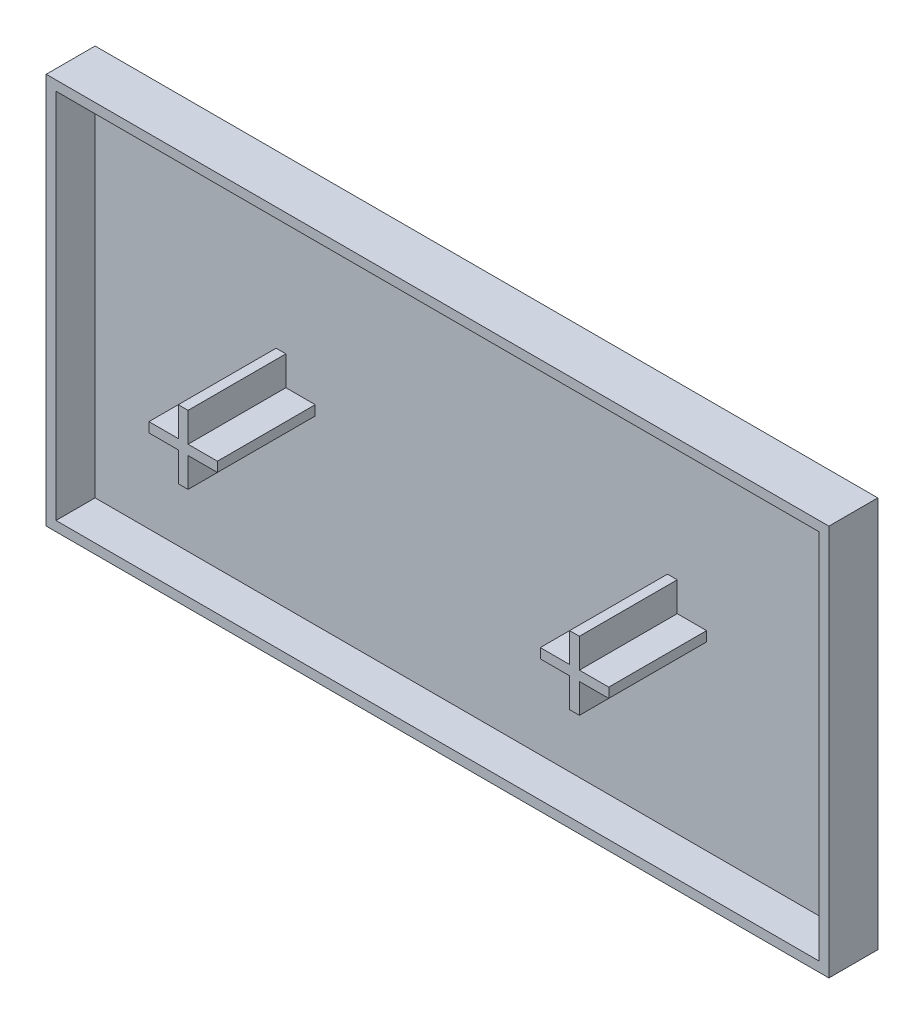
ISO-10303-21;
HEADER;
FILE_DESCRIPTION(('STEP AP214'),'2;1');
FILE_NAME('part.step','',(''),(''),'','','');
FILE_SCHEMA(('AUTOMOTIVE_DESIGN { 1 0 10303 214 1 1 1 1 }'));
ENDSEC;
DATA;
#1=APPLICATION_CONTEXT('core data for automotive mechanical design processes');
#2=APPLICATION_PROTOCOL_DEFINITION('international standard','automotive_design',2000,#1);
#3=PRODUCT_CONTEXT('',#1,'mechanical');
#4=PRODUCT('Part','Part','',(#3));
#5=PRODUCT_RELATED_PRODUCT_CATEGORY('part','',(#4));
#6=PRODUCT_DEFINITION_FORMATION('','',#4);
#7=PRODUCT_DEFINITION_CONTEXT('part definition',#1,'design');
#8=PRODUCT_DEFINITION('design','',#6,#7);
#9=PRODUCT_DEFINITION_SHAPE('','',#8);
#10=(LENGTH_UNIT() NAMED_UNIT(*) SI_UNIT(.MILLI.,.METRE.));
#11=(NAMED_UNIT(*) PLANE_ANGLE_UNIT() SI_UNIT($,.RADIAN.));
#12=(NAMED_UNIT(*) SI_UNIT($,.STERADIAN.) SOLID_ANGLE_UNIT());
#13=UNCERTAINTY_MEASURE_WITH_UNIT(LENGTH_MEASURE(1.E-05),#10,'distance_accuracy_value','');
#14=(GEOMETRIC_REPRESENTATION_CONTEXT(3) GLOBAL_UNCERTAINTY_ASSIGNED_CONTEXT((#13)) GLOBAL_UNIT_ASSIGNED_CONTEXT((#10,
#11,#12)) REPRESENTATION_CONTEXT('',''));
#15=CARTESIAN_POINT('',(0.,0.,0.));
#16=DIRECTION('',(0.,0.,1.));
#17=DIRECTION('',(1.,0.,0.));
#18=AXIS2_PLACEMENT_3D('',#15,#16,#17);
#19=CARTESIAN_POINT('',(0.,0.,-1.5));
#20=DIRECTION('',(0.,0.,1.));
#21=DIRECTION('',(1.,0.,0.));
#22=AXIS2_PLACEMENT_3D('',#19,#20,#21);
#23=PLANE('',#22);
#24=DIRECTION('',(1.,0.,0.));
#25=VECTOR('',#24,1.);
#26=CARTESIAN_POINT('',(-23.5,-0.5,-1.5));
#27=LINE('',#26,#25);
#28=CARTESIAN_POINT('',(-23.5,-0.5,-1.5));
#29=VERTEX_POINT('',#28);
#30=CARTESIAN_POINT('',(-20.5,-0.5,-1.5));
#31=VERTEX_POINT('',#30);
#32=EDGE_CURVE('E273',#29,#31,#27,.T.);
#33=ORIENTED_EDGE('',*,*,#32,.F.);
#34=DIRECTION('',(0.,-1.,0.));
#35=VECTOR('',#34,1.);
#36=CARTESIAN_POINT('',(-23.5,0.5,-1.5));
#37=LINE('',#36,#35);
#38=CARTESIAN_POINT('',(-23.5,0.5,-1.5));
#39=VERTEX_POINT('',#38);
#40=EDGE_CURVE('E270',#39,#29,#37,.T.);
#41=ORIENTED_EDGE('',*,*,#40,.F.);
#42=DIRECTION('',(-1.,0.,0.));
#43=VECTOR('',#42,1.);
#44=CARTESIAN_POINT('',(-23.5,0.5,-1.5));
#45=LINE('',#44,#43);
#46=CARTESIAN_POINT('',(-20.5,0.5,-1.5));
#47=VERTEX_POINT('',#46);
#48=EDGE_CURVE('E283',#47,#39,#45,.T.);
#49=ORIENTED_EDGE('',*,*,#48,.F.);
#50=DIRECTION('',(0.,-1.,0.));
#51=VECTOR('',#50,1.);
#52=CARTESIAN_POINT('',(-20.5,3.5,-1.5));
#53=LINE('',#52,#51);
#54=CARTESIAN_POINT('',(-20.5,3.5,-1.5));
#55=VERTEX_POINT('',#54);
#56=EDGE_CURVE('E323',#55,#47,#53,.T.);
#57=ORIENTED_EDGE('',*,*,#56,.F.);
#58=DIRECTION('',(-1.,0.,0.));
#59=VECTOR('',#58,1.);
#60=CARTESIAN_POINT('',(-20.5,3.5,-1.5));
#61=LINE('',#60,#59);
#62=CARTESIAN_POINT('',(-19.5,3.5,-1.5));
#63=VERTEX_POINT('',#62);
#64=EDGE_CURVE('E321',#63,#55,#61,.T.);
#65=ORIENTED_EDGE('',*,*,#64,.F.);
#66=DIRECTION('',(0.,1.,0.));
#67=VECTOR('',#66,1.);
#68=CARTESIAN_POINT('',(-19.5,3.5,-1.5));
#69=LINE('',#68,#67);
#70=CARTESIAN_POINT('',(-19.5,0.5,-1.5));
#71=VERTEX_POINT('',#70);
#72=EDGE_CURVE('E319',#71,#63,#69,.T.);
#73=ORIENTED_EDGE('',*,*,#72,.F.);
#74=DIRECTION('',(-1.,0.,0.));
#75=VECTOR('',#74,1.);
#76=CARTESIAN_POINT('',(-19.5,0.5,-1.5));
#77=LINE('',#76,#75);
#78=CARTESIAN_POINT('',(-16.5,0.5,-1.5));
#79=VERTEX_POINT('',#78);
#80=EDGE_CURVE('E317',#79,#71,#77,.T.);
#81=ORIENTED_EDGE('',*,*,#80,.F.);
#82=DIRECTION('',(0.,1.,0.));
#83=VECTOR('',#82,1.);
#84=CARTESIAN_POINT('',(-16.5,0.5,-1.5));
#85=LINE('',#84,#83);
#86=CARTESIAN_POINT('',(-16.5,-0.5,-1.5));
#87=VERTEX_POINT('',#86);
#88=EDGE_CURVE('E315',#87,#79,#85,.T.);
#89=ORIENTED_EDGE('',*,*,#88,.F.);
#90=DIRECTION('',(1.,0.,0.));
#91=VECTOR('',#90,1.);
#92=CARTESIAN_POINT('',(-19.5,-0.5,-1.5));
#93=LINE('',#92,#91);
#94=CARTESIAN_POINT('',(-19.5,-0.5,-1.5));
#95=VERTEX_POINT('',#94);
#96=EDGE_CURVE('E313',#95,#87,#93,.T.);
#97=ORIENTED_EDGE('',*,*,#96,.F.);
#98=DIRECTION('',(0.,1.,0.));
#99=VECTOR('',#98,1.);
#100=CARTESIAN_POINT('',(-19.5,-0.5,-1.5));
#101=LINE('',#100,#99);
#102=CARTESIAN_POINT('',(-19.5,-3.5,-1.5));
#103=VERTEX_POINT('',#102);
#104=EDGE_CURVE('E311',#103,#95,#101,.T.);
#105=ORIENTED_EDGE('',*,*,#104,.F.);
#106=DIRECTION('',(1.,0.,0.));
#107=VECTOR('',#106,1.);
#108=CARTESIAN_POINT('',(-20.5,-3.5,-1.5));
#109=LINE('',#108,#107);
#110=CARTESIAN_POINT('',(-20.5,-3.5,-1.5));
#111=VERTEX_POINT('',#110);
#112=EDGE_CURVE('E309',#111,#103,#109,.T.);
#113=ORIENTED_EDGE('',*,*,#112,.F.);
#114=DIRECTION('',(0.,-1.,0.));
#115=VECTOR('',#114,1.);
#116=CARTESIAN_POINT('',(-20.5,-0.5,-1.5));
#117=LINE('',#116,#115);
#118=EDGE_CURVE('E307',#31,#111,#117,.T.);
#119=ORIENTED_EDGE('',*,*,#118,.F.);
#120=EDGE_LOOP('',(#33,#41,#49,#57,#65,#73,#81,#89,#97,#105,#113,#119));
#121=FACE_BOUND('',#120,.T.);
#122=DIRECTION('',(0.,-1.,0.));
#123=VECTOR('',#122,1.);
#124=CARTESIAN_POINT('',(-39.,20.,-1.5));
#125=LINE('',#124,#123);
#126=CARTESIAN_POINT('',(-39.,19.,-1.5));
#127=VERTEX_POINT('',#126);
#128=CARTESIAN_POINT('',(-39.,-19.,-1.5));
#129=VERTEX_POINT('',#128);
#130=EDGE_CURVE('E358',#127,#129,#125,.T.);
#131=ORIENTED_EDGE('',*,*,#130,.T.);
#132=DIRECTION('',(1.,0.,0.));
#133=VECTOR('',#132,1.);
#134=CARTESIAN_POINT('',(-40.,-19.,-1.5));
#135=LINE('',#134,#133);
#136=CARTESIAN_POINT('',(39.,-19.,-1.5));
#137=VERTEX_POINT('',#136);
#138=EDGE_CURVE('E361',#129,#137,#135,.T.);
#139=ORIENTED_EDGE('',*,*,#138,.T.);
#140=DIRECTION('',(0.,1.,0.));
#141=VECTOR('',#140,1.);
#142=CARTESIAN_POINT('',(39.,20.,-1.5));
#143=LINE('',#142,#141);
#144=CARTESIAN_POINT('',(39.,19.,-1.5));
#145=VERTEX_POINT('',#144);
#146=EDGE_CURVE('E373',#137,#145,#143,.T.);
#147=ORIENTED_EDGE('',*,*,#146,.T.);
#148=DIRECTION('',(-1.,0.,0.));
#149=VECTOR('',#148,1.);
#150=CARTESIAN_POINT('',(-40.,19.,-1.5));
#151=LINE('',#150,#149);
#152=EDGE_CURVE('E377',#145,#127,#151,.T.);
#153=ORIENTED_EDGE('',*,*,#152,.T.);
#154=EDGE_LOOP('',(#131,#139,#147,#153));
#155=FACE_BOUND('',#154,.T.);
#156=DIRECTION('',(1.,0.,0.));
#157=VECTOR('',#156,1.);
#158=CARTESIAN_POINT('',(20.5,-3.49999999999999,-1.5));
#159=LINE('',#158,#157);
#160=CARTESIAN_POINT('',(19.5,-3.49999999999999,-1.5));
#161=VERTEX_POINT('',#160);
#162=CARTESIAN_POINT('',(20.5,-3.49999999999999,-1.5));
#163=VERTEX_POINT('',#162);
#164=EDGE_CURVE('E809',#161,#163,#159,.T.);
#165=ORIENTED_EDGE('',*,*,#164,.F.);
#166=DIRECTION('',(0.,-1.,0.));
#167=VECTOR('',#166,1.);
#168=CARTESIAN_POINT('',(19.5,-0.499999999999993,-1.5));
#169=LINE('',#168,#167);
#170=CARTESIAN_POINT('',(19.5,-0.499999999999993,-1.5));
#171=VERTEX_POINT('',#170);
#172=EDGE_CURVE('E268',#171,#161,#169,.T.);
#173=ORIENTED_EDGE('',*,*,#172,.F.);
#174=DIRECTION('',(1.,0.,0.));
#175=VECTOR('',#174,1.);
#176=CARTESIAN_POINT('',(19.5,-0.499999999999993,-1.5));
#177=LINE('',#176,#175);
#178=CARTESIAN_POINT('',(16.5,-0.499999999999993,-1.5));
#179=VERTEX_POINT('',#178);
#180=EDGE_CURVE('E264',#179,#171,#177,.T.);
#181=ORIENTED_EDGE('',*,*,#180,.F.);
#182=DIRECTION('',(0.,-1.,0.));
#183=VECTOR('',#182,1.);
#184=CARTESIAN_POINT('',(16.5,0.500000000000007,-1.5));
#185=LINE('',#184,#183);
#186=CARTESIAN_POINT('',(16.5,0.500000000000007,-1.5));
#187=VERTEX_POINT('',#186);
#188=EDGE_CURVE('E805',#187,#179,#185,.T.);
#189=ORIENTED_EDGE('',*,*,#188,.F.);
#190=DIRECTION('',(-1.,0.,0.));
#191=VECTOR('',#190,1.);
#192=CARTESIAN_POINT('',(19.5,0.500000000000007,-1.5));
#193=LINE('',#192,#191);
#194=CARTESIAN_POINT('',(19.5,0.500000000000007,-1.5));
#195=VERTEX_POINT('',#194);
#196=EDGE_CURVE('E829',#195,#187,#193,.T.);
#197=ORIENTED_EDGE('',*,*,#196,.F.);
#198=DIRECTION('',(0.,-1.,0.));
#199=VECTOR('',#198,1.);
#200=CARTESIAN_POINT('',(19.5,3.50000000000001,-1.5));
#201=LINE('',#200,#199);
#202=CARTESIAN_POINT('',(19.5,3.50000000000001,-1.5));
#203=VERTEX_POINT('',#202);
#204=EDGE_CURVE('E827',#203,#195,#201,.T.);
#205=ORIENTED_EDGE('',*,*,#204,.F.);
#206=DIRECTION('',(-1.,0.,0.));
#207=VECTOR('',#206,1.);
#208=CARTESIAN_POINT('',(20.5,3.50000000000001,-1.5));
#209=LINE('',#208,#207);
#210=CARTESIAN_POINT('',(20.5,3.50000000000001,-1.5));
#211=VERTEX_POINT('',#210);
#212=EDGE_CURVE('E825',#211,#203,#209,.T.);
#213=ORIENTED_EDGE('',*,*,#212,.F.);
#214=DIRECTION('',(0.,1.,0.));
#215=VECTOR('',#214,1.);
#216=CARTESIAN_POINT('',(20.5,3.50000000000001,-1.5));
#217=LINE('',#216,#215);
#218=CARTESIAN_POINT('',(20.5,0.500000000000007,-1.5));
#219=VERTEX_POINT('',#218);
#220=EDGE_CURVE('E823',#219,#211,#217,.T.);
#221=ORIENTED_EDGE('',*,*,#220,.F.);
#222=DIRECTION('',(-1.,0.,0.));
#223=VECTOR('',#222,1.);
#224=CARTESIAN_POINT('',(23.5,0.500000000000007,-1.5));
#225=LINE('',#224,#223);
#226=CARTESIAN_POINT('',(23.5,0.500000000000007,-1.5));
#227=VERTEX_POINT('',#226);
#228=EDGE_CURVE('E821',#227,#219,#225,.T.);
#229=ORIENTED_EDGE('',*,*,#228,.F.);
#230=DIRECTION('',(0.,1.,0.));
#231=VECTOR('',#230,1.);
#232=CARTESIAN_POINT('',(23.5,0.500000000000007,-1.5));
#233=LINE('',#232,#231);
#234=CARTESIAN_POINT('',(23.5,-0.499999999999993,-1.5));
#235=VERTEX_POINT('',#234);
#236=EDGE_CURVE('E819',#235,#227,#233,.T.);
#237=ORIENTED_EDGE('',*,*,#236,.F.);
#238=DIRECTION('',(1.,0.,0.));
#239=VECTOR('',#238,1.);
#240=CARTESIAN_POINT('',(23.5,-0.499999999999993,-1.5));
#241=LINE('',#240,#239);
#242=CARTESIAN_POINT('',(20.5,-0.499999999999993,-1.5));
#243=VERTEX_POINT('',#242);
#244=EDGE_CURVE('E817',#243,#235,#241,.T.);
#245=ORIENTED_EDGE('',*,*,#244,.F.);
#246=DIRECTION('',(0.,1.,0.));
#247=VECTOR('',#246,1.);
#248=CARTESIAN_POINT('',(20.5,-0.499999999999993,-1.5));
#249=LINE('',#248,#247);
#250=EDGE_CURVE('E811',#163,#243,#249,.T.);
#251=ORIENTED_EDGE('',*,*,#250,.F.);
#252=EDGE_LOOP('',(#165,#173,#181,#189,#197,#205,#213,#221,#229,#237,#245,#251));
#253=FACE_BOUND('',#252,.T.);
#254=ADVANCED_FACE('F35',(#121,#155,#253),#23,.T.);
#255=CARTESIAN_POINT('',(-40.,20.,2.5));
#256=DIRECTION('',(1.,0.,0.));
#257=DIRECTION('',(0.,1.,0.));
#258=AXIS2_PLACEMENT_3D('',#255,#256,#257);
#259=PLANE('',#258);
#260=DIRECTION('',(0.,-1.,0.));
#261=VECTOR('',#260,1.);
#262=CARTESIAN_POINT('',(-40.,20.,-2.5));
#263=LINE('',#262,#261);
#264=CARTESIAN_POINT('',(-40.,20.,-2.5));
#265=VERTEX_POINT('',#264);
#266=CARTESIAN_POINT('',(-40.,-20.,-2.5));
#267=VERTEX_POINT('',#266);
#268=EDGE_CURVE('E365',#265,#267,#263,.T.);
#269=ORIENTED_EDGE('',*,*,#268,.T.);
#270=DIRECTION('',(0.,0.,-1.));
#271=VECTOR('',#270,1.);
#272=CARTESIAN_POINT('',(-40.,-20.,2.5));
#273=LINE('',#272,#271);
#274=CARTESIAN_POINT('',(-40.,-20.,2.5));
#275=VERTEX_POINT('',#274);
#276=EDGE_CURVE('E11',#275,#267,#273,.T.);
#277=ORIENTED_EDGE('',*,*,#276,.F.);
#278=DIRECTION('',(0.,-1.,0.));
#279=VECTOR('',#278,1.);
#280=CARTESIAN_POINT('',(-40.,20.,2.5));
#281=LINE('',#280,#279);
#282=CARTESIAN_POINT('',(-40.,20.,2.5));
#283=VERTEX_POINT('',#282);
#284=EDGE_CURVE('E389',#283,#275,#281,.T.);
#285=ORIENTED_EDGE('',*,*,#284,.F.);
#286=DIRECTION('',(0.,0.,-1.));
#287=VECTOR('',#286,1.);
#288=CARTESIAN_POINT('',(-40.,20.,2.5));
#289=LINE('',#288,#287);
#290=EDGE_CURVE('E399',#283,#265,#289,.T.);
#291=ORIENTED_EDGE('',*,*,#290,.T.);
#292=EDGE_LOOP('',(#269,#277,#285,#291));
#293=FACE_BOUND('',#292,.T.);
#294=ADVANCED_FACE('F37',(#293),#259,.F.);
#295=CARTESIAN_POINT('',(-40.,-20.,2.5));
#296=DIRECTION('',(0.,1.,0.));
#297=DIRECTION('',(-1.,0.,0.));
#298=AXIS2_PLACEMENT_3D('',#295,#296,#297);
#299=PLANE('',#298);
#300=DIRECTION('',(1.,0.,0.));
#301=VECTOR('',#300,1.);
#302=CARTESIAN_POINT('',(-40.,-20.,-2.5));
#303=LINE('',#302,#301);
#304=CARTESIAN_POINT('',(40.,-20.,-2.5));
#305=VERTEX_POINT('',#304);
#306=EDGE_CURVE('E402',#267,#305,#303,.T.);
#307=ORIENTED_EDGE('',*,*,#306,.T.);
#308=DIRECTION('',(0.,0.,-1.));
#309=VECTOR('',#308,1.);
#310=CARTESIAN_POINT('',(40.,-20.,2.5));
#311=LINE('',#310,#309);
#312=CARTESIAN_POINT('',(40.,-20.,2.5));
#313=VERTEX_POINT('',#312);
#314=EDGE_CURVE('E43',#313,#305,#311,.T.);
#315=ORIENTED_EDGE('',*,*,#314,.F.);
#316=DIRECTION('',(1.,0.,0.));
#317=VECTOR('',#316,1.);
#318=CARTESIAN_POINT('',(-40.,-20.,2.5));
#319=LINE('',#318,#317);
#320=EDGE_CURVE('E392',#275,#313,#319,.T.);
#321=ORIENTED_EDGE('',*,*,#320,.F.);
#322=ORIENTED_EDGE('',*,*,#276,.T.);
#323=EDGE_LOOP('',(#307,#315,#321,#322));
#324=FACE_BOUND('',#323,.T.);
#325=ADVANCED_FACE('F432',(#324),#299,.F.);
#326=CARTESIAN_POINT('',(40.,20.,2.5));
#327=DIRECTION('',(-1.,0.,0.));
#328=DIRECTION('',(0.,0.,1.));
#329=AXIS2_PLACEMENT_3D('',#326,#327,#328);
#330=PLANE('',#329);
#331=DIRECTION('',(0.,1.,0.));
#332=VECTOR('',#331,1.);
#333=CARTESIAN_POINT('',(40.,20.,-2.5));
#334=LINE('',#333,#332);
#335=CARTESIAN_POINT('',(40.,20.,-2.5));
#336=VERTEX_POINT('',#335);
#337=EDGE_CURVE('E404',#305,#336,#334,.T.);
#338=ORIENTED_EDGE('',*,*,#337,.T.);
#339=DIRECTION('',(0.,0.,-1.));
#340=VECTOR('',#339,1.);
#341=CARTESIAN_POINT('',(40.,20.,2.5));
#342=LINE('',#341,#340);
#343=CARTESIAN_POINT('',(40.,20.,2.5));
#344=VERTEX_POINT('',#343);
#345=EDGE_CURVE('E409',#344,#336,#342,.T.);
#346=ORIENTED_EDGE('',*,*,#345,.F.);
#347=DIRECTION('',(0.,1.,0.));
#348=VECTOR('',#347,1.);
#349=CARTESIAN_POINT('',(40.,20.,2.5));
#350=LINE('',#349,#348);
#351=EDGE_CURVE('E395',#313,#344,#350,.T.);
#352=ORIENTED_EDGE('',*,*,#351,.F.);
#353=ORIENTED_EDGE('',*,*,#314,.T.);
#354=EDGE_LOOP('',(#338,#346,#352,#353));
#355=FACE_BOUND('',#354,.T.);
#356=ADVANCED_FACE('F416',(#355),#330,.F.);
#357=CARTESIAN_POINT('',(-40.,20.,2.5));
#358=DIRECTION('',(0.,-1.,0.));
#359=DIRECTION('',(0.,0.,-1.));
#360=AXIS2_PLACEMENT_3D('',#357,#358,#359);
#361=PLANE('',#360);
#362=DIRECTION('',(-1.,0.,0.));
#363=VECTOR('',#362,1.);
#364=CARTESIAN_POINT('',(-40.,20.,-2.5));
#365=LINE('',#364,#363);
#366=EDGE_CURVE('E393',#336,#265,#365,.T.);
#367=ORIENTED_EDGE('',*,*,#366,.T.);
#368=ORIENTED_EDGE('',*,*,#290,.F.);
#369=DIRECTION('',(-1.,0.,0.));
#370=VECTOR('',#369,1.);
#371=CARTESIAN_POINT('',(-40.,20.,2.5));
#372=LINE('',#371,#370);
#373=EDGE_CURVE('E397',#344,#283,#372,.T.);
#374=ORIENTED_EDGE('',*,*,#373,.F.);
#375=ORIENTED_EDGE('',*,*,#345,.T.);
#376=EDGE_LOOP('',(#367,#368,#374,#375));
#377=FACE_BOUND('',#376,.T.);
#378=ADVANCED_FACE('F425',(#377),#361,.F.);
#379=CARTESIAN_POINT('',(0.,0.,2.5));
#380=DIRECTION('',(0.,0.,1.));
#381=DIRECTION('',(1.,0.,0.));
#382=AXIS2_PLACEMENT_3D('',#379,#380,#381);
#383=PLANE('',#382);
#384=DIRECTION('',(0.,-1.,0.));
#385=VECTOR('',#384,1.);
#386=CARTESIAN_POINT('',(-39.,20.,2.5));
#387=LINE('',#386,#385);
#388=CARTESIAN_POINT('',(-39.,19.,2.5));
#389=VERTEX_POINT('',#388);
#390=CARTESIAN_POINT('',(-39.,-19.,2.5));
#391=VERTEX_POINT('',#390);
#392=EDGE_CURVE('E381',#389,#391,#387,.T.);
#393=ORIENTED_EDGE('',*,*,#392,.F.);
#394=DIRECTION('',(-1.,0.,0.));
#395=VECTOR('',#394,1.);
#396=CARTESIAN_POINT('',(-40.,19.,2.5));
#397=LINE('',#396,#395);
#398=CARTESIAN_POINT('',(39.,19.,2.5));
#399=VERTEX_POINT('',#398);
#400=EDGE_CURVE('E371',#399,#389,#397,.T.);
#401=ORIENTED_EDGE('',*,*,#400,.F.);
#402=DIRECTION('',(0.,1.,0.));
#403=VECTOR('',#402,1.);
#404=CARTESIAN_POINT('',(39.,20.,2.5));
#405=LINE('',#404,#403);
#406=CARTESIAN_POINT('',(39.,-19.,2.5));
#407=VERTEX_POINT('',#406);
#408=EDGE_CURVE('E385',#407,#399,#405,.T.);
#409=ORIENTED_EDGE('',*,*,#408,.F.);
#410=DIRECTION('',(1.,0.,0.));
#411=VECTOR('',#410,1.);
#412=CARTESIAN_POINT('',(-40.,-19.,2.5));
#413=LINE('',#412,#411);
#414=EDGE_CURVE('E383',#391,#407,#413,.T.);
#415=ORIENTED_EDGE('',*,*,#414,.F.);
#416=EDGE_LOOP('',(#393,#401,#409,#415));
#417=FACE_BOUND('',#416,.T.);
#418=ORIENTED_EDGE('',*,*,#284,.T.);
#419=ORIENTED_EDGE('',*,*,#320,.T.);
#420=ORIENTED_EDGE('',*,*,#351,.T.);
#421=ORIENTED_EDGE('',*,*,#373,.T.);
#422=EDGE_LOOP('',(#418,#419,#420,#421));
#423=FACE_BOUND('',#422,.T.);
#424=ADVANCED_FACE('F431',(#417,#423),#383,.T.);
#425=CARTESIAN_POINT('',(0.,0.,-2.5));
#426=DIRECTION('',(0.,0.,1.));
#427=DIRECTION('',(1.,0.,0.));
#428=AXIS2_PLACEMENT_3D('',#425,#426,#427);
#429=PLANE('',#428);
#430=ORIENTED_EDGE('',*,*,#268,.F.);
#431=ORIENTED_EDGE('',*,*,#366,.F.);
#432=ORIENTED_EDGE('',*,*,#337,.F.);
#433=ORIENTED_EDGE('',*,*,#306,.F.);
#434=EDGE_LOOP('',(#430,#431,#432,#433));
#435=FACE_BOUND('',#434,.T.);
#436=ADVANCED_FACE('F422',(#435),#429,.F.);
#437=CARTESIAN_POINT('',(-39.,20.,2.5));
#438=DIRECTION('',(1.,0.,0.));
#439=DIRECTION('',(0.,1.,0.));
#440=AXIS2_PLACEMENT_3D('',#437,#438,#439);
#441=PLANE('',#440);
#442=ORIENTED_EDGE('',*,*,#130,.F.);
#443=DIRECTION('',(0.,0.,-1.));
#444=VECTOR('',#443,1.);
#445=CARTESIAN_POINT('',(-39.,19.,2.5));
#446=LINE('',#445,#444);
#447=EDGE_CURVE('E367',#389,#127,#446,.T.);
#448=ORIENTED_EDGE('',*,*,#447,.F.);
#449=ORIENTED_EDGE('',*,*,#392,.T.);
#450=DIRECTION('',(0.,0.,-1.));
#451=VECTOR('',#450,1.);
#452=CARTESIAN_POINT('',(-39.,-19.,2.5));
#453=LINE('',#452,#451);
#454=EDGE_CURVE('E362',#391,#129,#453,.T.);
#455=ORIENTED_EDGE('',*,*,#454,.T.);
#456=EDGE_LOOP('',(#442,#448,#449,#455));
#457=FACE_BOUND('',#456,.T.);
#458=ADVANCED_FACE('F455',(#457),#441,.T.);
#459=CARTESIAN_POINT('',(-40.,-19.,2.5));
#460=DIRECTION('',(0.,1.,0.));
#461=DIRECTION('',(-1.,0.,0.));
#462=AXIS2_PLACEMENT_3D('',#459,#460,#461);
#463=PLANE('',#462);
#464=ORIENTED_EDGE('',*,*,#138,.F.);
#465=ORIENTED_EDGE('',*,*,#454,.F.);
#466=ORIENTED_EDGE('',*,*,#414,.T.);
#467=DIRECTION('',(0.,0.,-1.));
#468=VECTOR('',#467,1.);
#469=CARTESIAN_POINT('',(39.,-19.,2.5));
#470=LINE('',#469,#468);
#471=EDGE_CURVE('E366',#407,#137,#470,.T.);
#472=ORIENTED_EDGE('',*,*,#471,.T.);
#473=EDGE_LOOP('',(#464,#465,#466,#472));
#474=FACE_BOUND('',#473,.T.);
#475=ADVANCED_FACE('F475',(#474),#463,.T.);
#476=CARTESIAN_POINT('',(39.,20.,2.5));
#477=DIRECTION('',(-1.,0.,0.));
#478=DIRECTION('',(0.,0.,1.));
#479=AXIS2_PLACEMENT_3D('',#476,#477,#478);
#480=PLANE('',#479);
#481=ORIENTED_EDGE('',*,*,#146,.F.);
#482=ORIENTED_EDGE('',*,*,#471,.F.);
#483=ORIENTED_EDGE('',*,*,#408,.T.);
#484=DIRECTION('',(0.,0.,-1.));
#485=VECTOR('',#484,1.);
#486=CARTESIAN_POINT('',(39.,19.,2.5));
#487=LINE('',#486,#485);
#488=EDGE_CURVE('E370',#399,#145,#487,.T.);
#489=ORIENTED_EDGE('',*,*,#488,.T.);
#490=EDGE_LOOP('',(#481,#482,#483,#489));
#491=FACE_BOUND('',#490,.T.);
#492=ADVANCED_FACE('F483',(#491),#480,.T.);
#493=CARTESIAN_POINT('',(-40.,19.,2.5));
#494=DIRECTION('',(0.,-1.,0.));
#495=DIRECTION('',(0.,0.,-1.));
#496=AXIS2_PLACEMENT_3D('',#493,#494,#495);
#497=PLANE('',#496);
#498=ORIENTED_EDGE('',*,*,#152,.F.);
#499=ORIENTED_EDGE('',*,*,#488,.F.);
#500=ORIENTED_EDGE('',*,*,#400,.T.);
#501=ORIENTED_EDGE('',*,*,#447,.T.);
#502=EDGE_LOOP('',(#498,#499,#500,#501));
#503=FACE_BOUND('',#502,.T.);
#504=ADVANCED_FACE('F448',(#503),#497,.T.);
#505=CARTESIAN_POINT('',(-23.5,0.5,8.5));
#506=DIRECTION('',(1.,0.,0.));
#507=DIRECTION('',(0.,0.,-1.));
#508=AXIS2_PLACEMENT_3D('',#505,#506,#507);
#509=PLANE('',#508);
#510=ORIENTED_EDGE('',*,*,#40,.T.);
#511=DIRECTION('',(0.,0.,-1.));
#512=VECTOR('',#511,1.);
#513=CARTESIAN_POINT('',(-23.5,-0.5,8.5));
#514=LINE('',#513,#512);
#515=CARTESIAN_POINT('',(-23.5,-0.5,8.5));
#516=VERTEX_POINT('',#515);
#517=EDGE_CURVE('E356',#516,#29,#514,.T.);
#518=ORIENTED_EDGE('',*,*,#517,.F.);
#519=DIRECTION('',(0.,-1.,0.));
#520=VECTOR('',#519,1.);
#521=CARTESIAN_POINT('',(-23.5,0.5,8.5));
#522=LINE('',#521,#520);
#523=CARTESIAN_POINT('',(-23.5,0.5,8.5));
#524=VERTEX_POINT('',#523);
#525=EDGE_CURVE('E279',#524,#516,#522,.T.);
#526=ORIENTED_EDGE('',*,*,#525,.F.);
#527=DIRECTION('',(0.,0.,-1.));
#528=VECTOR('',#527,1.);
#529=CARTESIAN_POINT('',(-23.5,0.5,8.5));
#530=LINE('',#529,#528);
#531=EDGE_CURVE('E304',#524,#39,#530,.T.);
#532=ORIENTED_EDGE('',*,*,#531,.T.);
#533=EDGE_LOOP('',(#510,#518,#526,#532));
#534=FACE_BOUND('',#533,.T.);
#535=ADVANCED_FACE('F497',(#534),#509,.F.);
#536=CARTESIAN_POINT('',(-23.5,-0.5,8.5));
#537=DIRECTION('',(0.,1.,0.));
#538=DIRECTION('',(0.,0.,1.));
#539=AXIS2_PLACEMENT_3D('',#536,#537,#538);
#540=PLANE('',#539);
#541=ORIENTED_EDGE('',*,*,#32,.T.);
#542=DIRECTION('',(0.,0.,-1.));
#543=VECTOR('',#542,1.);
#544=CARTESIAN_POINT('',(-20.5,-0.5,8.5));
#545=LINE('',#544,#543);
#546=CARTESIAN_POINT('',(-20.5,-0.5,8.5));
#547=VERTEX_POINT('',#546);
#548=EDGE_CURVE('E353',#547,#31,#545,.T.);
#549=ORIENTED_EDGE('',*,*,#548,.F.);
#550=DIRECTION('',(1.,0.,0.));
#551=VECTOR('',#550,1.);
#552=CARTESIAN_POINT('',(-23.5,-0.5,8.5));
#553=LINE('',#552,#551);
#554=EDGE_CURVE('E282',#516,#547,#553,.T.);
#555=ORIENTED_EDGE('',*,*,#554,.F.);
#556=ORIENTED_EDGE('',*,*,#517,.T.);
#557=EDGE_LOOP('',(#541,#549,#555,#556));
#558=FACE_BOUND('',#557,.T.);
#559=ADVANCED_FACE('F504',(#558),#540,.F.);
#560=CARTESIAN_POINT('',(-20.5,-0.5,8.5));
#561=DIRECTION('',(1.,0.,0.));
#562=DIRECTION('',(0.,0.,-1.));
#563=AXIS2_PLACEMENT_3D('',#560,#561,#562);
#564=PLANE('',#563);
#565=ORIENTED_EDGE('',*,*,#118,.T.);
#566=DIRECTION('',(0.,0.,-1.));
#567=VECTOR('',#566,1.);
#568=CARTESIAN_POINT('',(-20.5,-3.5,8.5));
#569=LINE('',#568,#567);
#570=CARTESIAN_POINT('',(-20.5,-3.5,8.5));
#571=VERTEX_POINT('',#570);
#572=EDGE_CURVE('E350',#571,#111,#569,.T.);
#573=ORIENTED_EDGE('',*,*,#572,.F.);
#574=DIRECTION('',(0.,-1.,0.));
#575=VECTOR('',#574,1.);
#576=CARTESIAN_POINT('',(-20.5,-0.5,8.5));
#577=LINE('',#576,#575);
#578=EDGE_CURVE('E285',#547,#571,#577,.T.);
#579=ORIENTED_EDGE('',*,*,#578,.F.);
#580=ORIENTED_EDGE('',*,*,#548,.T.);
#581=EDGE_LOOP('',(#565,#573,#579,#580));
#582=FACE_BOUND('',#581,.T.);
#583=ADVANCED_FACE('F512',(#582),#564,.F.);
#584=CARTESIAN_POINT('',(-20.5,-3.5,8.5));
#585=DIRECTION('',(0.,1.,0.));
#586=DIRECTION('',(0.,0.,1.));
#587=AXIS2_PLACEMENT_3D('',#584,#585,#586);
#588=PLANE('',#587);
#589=ORIENTED_EDGE('',*,*,#112,.T.);
#590=DIRECTION('',(0.,0.,-1.));
#591=VECTOR('',#590,1.);
#592=CARTESIAN_POINT('',(-19.5,-3.5,8.5));
#593=LINE('',#592,#591);
#594=CARTESIAN_POINT('',(-19.5,-3.5,8.5));
#595=VERTEX_POINT('',#594);
#596=EDGE_CURVE('E347',#595,#103,#593,.T.);
#597=ORIENTED_EDGE('',*,*,#596,.F.);
#598=DIRECTION('',(1.,0.,0.));
#599=VECTOR('',#598,1.);
#600=CARTESIAN_POINT('',(-20.5,-3.5,8.5));
#601=LINE('',#600,#599);
#602=EDGE_CURVE('E287',#571,#595,#601,.T.);
#603=ORIENTED_EDGE('',*,*,#602,.F.);
#604=ORIENTED_EDGE('',*,*,#572,.T.);
#605=EDGE_LOOP('',(#589,#597,#603,#604));
#606=FACE_BOUND('',#605,.T.);
#607=ADVANCED_FACE('F520',(#606),#588,.F.);
#608=CARTESIAN_POINT('',(-19.5,-0.5,8.5));
#609=DIRECTION('',(-1.,0.,0.));
#610=DIRECTION('',(0.,0.,1.));
#611=AXIS2_PLACEMENT_3D('',#608,#609,#610);
#612=PLANE('',#611);
#613=ORIENTED_EDGE('',*,*,#104,.T.);
#614=DIRECTION('',(0.,0.,-1.));
#615=VECTOR('',#614,1.);
#616=CARTESIAN_POINT('',(-19.5,-0.5,8.5));
#617=LINE('',#616,#615);
#618=CARTESIAN_POINT('',(-19.5,-0.5,8.5));
#619=VERTEX_POINT('',#618);
#620=EDGE_CURVE('E344',#619,#95,#617,.T.);
#621=ORIENTED_EDGE('',*,*,#620,.F.);
#622=DIRECTION('',(0.,1.,0.));
#623=VECTOR('',#622,1.);
#624=CARTESIAN_POINT('',(-19.5,-0.5,8.5));
#625=LINE('',#624,#623);
#626=EDGE_CURVE('E289',#595,#619,#625,.T.);
#627=ORIENTED_EDGE('',*,*,#626,.F.);
#628=ORIENTED_EDGE('',*,*,#596,.T.);
#629=EDGE_LOOP('',(#613,#621,#627,#628));
#630=FACE_BOUND('',#629,.T.);
#631=ADVANCED_FACE('F528',(#630),#612,.F.);
#632=CARTESIAN_POINT('',(-19.5,-0.5,8.5));
#633=DIRECTION('',(0.,1.,0.));
#634=DIRECTION('',(0.,0.,1.));
#635=AXIS2_PLACEMENT_3D('',#632,#633,#634);
#636=PLANE('',#635);
#637=ORIENTED_EDGE('',*,*,#96,.T.);
#638=DIRECTION('',(0.,0.,-1.));
#639=VECTOR('',#638,1.);
#640=CARTESIAN_POINT('',(-16.5,-0.5,8.5));
#641=LINE('',#640,#639);
#642=CARTESIAN_POINT('',(-16.5,-0.5,8.5));
#643=VERTEX_POINT('',#642);
#644=EDGE_CURVE('E341',#643,#87,#641,.T.);
#645=ORIENTED_EDGE('',*,*,#644,.F.);
#646=DIRECTION('',(1.,0.,0.));
#647=VECTOR('',#646,1.);
#648=CARTESIAN_POINT('',(-19.5,-0.5,8.5));
#649=LINE('',#648,#647);
#650=EDGE_CURVE('E291',#619,#643,#649,.T.);
#651=ORIENTED_EDGE('',*,*,#650,.F.);
#652=ORIENTED_EDGE('',*,*,#620,.T.);
#653=EDGE_LOOP('',(#637,#645,#651,#652));
#654=FACE_BOUND('',#653,.T.);
#655=ADVANCED_FACE('F536',(#654),#636,.F.);
#656=CARTESIAN_POINT('',(-16.5,0.5,8.5));
#657=DIRECTION('',(-1.,0.,0.));
#658=DIRECTION('',(0.,0.,1.));
#659=AXIS2_PLACEMENT_3D('',#656,#657,#658);
#660=PLANE('',#659);
#661=ORIENTED_EDGE('',*,*,#88,.T.);
#662=DIRECTION('',(0.,0.,-1.));
#663=VECTOR('',#662,1.);
#664=CARTESIAN_POINT('',(-16.5,0.5,8.5));
#665=LINE('',#664,#663);
#666=CARTESIAN_POINT('',(-16.5,0.5,8.5));
#667=VERTEX_POINT('',#666);
#668=EDGE_CURVE('E338',#667,#79,#665,.T.);
#669=ORIENTED_EDGE('',*,*,#668,.F.);
#670=DIRECTION('',(0.,1.,0.));
#671=VECTOR('',#670,1.);
#672=CARTESIAN_POINT('',(-16.5,0.5,8.5));
#673=LINE('',#672,#671);
#674=EDGE_CURVE('E293',#643,#667,#673,.T.);
#675=ORIENTED_EDGE('',*,*,#674,.F.);
#676=ORIENTED_EDGE('',*,*,#644,.T.);
#677=EDGE_LOOP('',(#661,#669,#675,#676));
#678=FACE_BOUND('',#677,.T.);
#679=ADVANCED_FACE('F544',(#678),#660,.F.);
#680=CARTESIAN_POINT('',(-19.5,0.5,8.5));
#681=DIRECTION('',(0.,-1.,0.));
#682=DIRECTION('',(1.,0.,0.));
#683=AXIS2_PLACEMENT_3D('',#680,#681,#682);
#684=PLANE('',#683);
#685=ORIENTED_EDGE('',*,*,#80,.T.);
#686=DIRECTION('',(0.,0.,-1.));
#687=VECTOR('',#686,1.);
#688=CARTESIAN_POINT('',(-19.5,0.5,8.5));
#689=LINE('',#688,#687);
#690=CARTESIAN_POINT('',(-19.5,0.5,8.5));
#691=VERTEX_POINT('',#690);
#692=EDGE_CURVE('E335',#691,#71,#689,.T.);
#693=ORIENTED_EDGE('',*,*,#692,.F.);
#694=DIRECTION('',(-1.,0.,0.));
#695=VECTOR('',#694,1.);
#696=CARTESIAN_POINT('',(-19.5,0.5,8.5));
#697=LINE('',#696,#695);
#698=EDGE_CURVE('E295',#667,#691,#697,.T.);
#699=ORIENTED_EDGE('',*,*,#698,.F.);
#700=ORIENTED_EDGE('',*,*,#668,.T.);
#701=EDGE_LOOP('',(#685,#693,#699,#700));
#702=FACE_BOUND('',#701,.T.);
#703=ADVANCED_FACE('F552',(#702),#684,.F.);
#704=CARTESIAN_POINT('',(-19.5,3.5,8.5));
#705=DIRECTION('',(-1.,0.,0.));
#706=DIRECTION('',(0.,0.,1.));
#707=AXIS2_PLACEMENT_3D('',#704,#705,#706);
#708=PLANE('',#707);
#709=ORIENTED_EDGE('',*,*,#72,.T.);
#710=DIRECTION('',(0.,0.,-1.));
#711=VECTOR('',#710,1.);
#712=CARTESIAN_POINT('',(-19.5,3.5,8.5));
#713=LINE('',#712,#711);
#714=CARTESIAN_POINT('',(-19.5,3.5,8.5));
#715=VERTEX_POINT('',#714);
#716=EDGE_CURVE('E332',#715,#63,#713,.T.);
#717=ORIENTED_EDGE('',*,*,#716,.F.);
#718=DIRECTION('',(0.,1.,0.));
#719=VECTOR('',#718,1.);
#720=CARTESIAN_POINT('',(-19.5,3.5,8.5));
#721=LINE('',#720,#719);
#722=EDGE_CURVE('E297',#691,#715,#721,.T.);
#723=ORIENTED_EDGE('',*,*,#722,.F.);
#724=ORIENTED_EDGE('',*,*,#692,.T.);
#725=EDGE_LOOP('',(#709,#717,#723,#724));
#726=FACE_BOUND('',#725,.T.);
#727=ADVANCED_FACE('F560',(#726),#708,.F.);
#728=CARTESIAN_POINT('',(-20.5,3.5,8.5));
#729=DIRECTION('',(0.,-1.,0.));
#730=DIRECTION('',(1.,0.,0.));
#731=AXIS2_PLACEMENT_3D('',#728,#729,#730);
#732=PLANE('',#731);
#733=ORIENTED_EDGE('',*,*,#64,.T.);
#734=DIRECTION('',(0.,0.,-1.));
#735=VECTOR('',#734,1.);
#736=CARTESIAN_POINT('',(-20.5,3.5,8.5));
#737=LINE('',#736,#735);
#738=CARTESIAN_POINT('',(-20.5,3.5,8.5));
#739=VERTEX_POINT('',#738);
#740=EDGE_CURVE('E329',#739,#55,#737,.T.);
#741=ORIENTED_EDGE('',*,*,#740,.F.);
#742=DIRECTION('',(-1.,0.,0.));
#743=VECTOR('',#742,1.);
#744=CARTESIAN_POINT('',(-20.5,3.5,8.5));
#745=LINE('',#744,#743);
#746=EDGE_CURVE('E299',#715,#739,#745,.T.);
#747=ORIENTED_EDGE('',*,*,#746,.F.);
#748=ORIENTED_EDGE('',*,*,#716,.T.);
#749=EDGE_LOOP('',(#733,#741,#747,#748));
#750=FACE_BOUND('',#749,.T.);
#751=ADVANCED_FACE('F568',(#750),#732,.F.);
#752=CARTESIAN_POINT('',(-20.5,3.5,8.5));
#753=DIRECTION('',(1.,0.,0.));
#754=DIRECTION('',(0.,0.,-1.));
#755=AXIS2_PLACEMENT_3D('',#752,#753,#754);
#756=PLANE('',#755);
#757=ORIENTED_EDGE('',*,*,#56,.T.);
#758=DIRECTION('',(0.,0.,-1.));
#759=VECTOR('',#758,1.);
#760=CARTESIAN_POINT('',(-20.5,0.5,8.5));
#761=LINE('',#760,#759);
#762=CARTESIAN_POINT('',(-20.5,0.5,8.5));
#763=VERTEX_POINT('',#762);
#764=EDGE_CURVE('E58',#763,#47,#761,.T.);
#765=ORIENTED_EDGE('',*,*,#764,.F.);
#766=DIRECTION('',(0.,-1.,0.));
#767=VECTOR('',#766,1.);
#768=CARTESIAN_POINT('',(-20.5,3.5,8.5));
#769=LINE('',#768,#767);
#770=EDGE_CURVE('E301',#739,#763,#769,.T.);
#771=ORIENTED_EDGE('',*,*,#770,.F.);
#772=ORIENTED_EDGE('',*,*,#740,.T.);
#773=EDGE_LOOP('',(#757,#765,#771,#772));
#774=FACE_BOUND('',#773,.T.);
#775=ADVANCED_FACE('F576',(#774),#756,.F.);
#776=CARTESIAN_POINT('',(-23.5,0.5,8.5));
#777=DIRECTION('',(0.,-1.,0.));
#778=DIRECTION('',(0.,0.,-1.));
#779=AXIS2_PLACEMENT_3D('',#776,#777,#778);
#780=PLANE('',#779);
#781=ORIENTED_EDGE('',*,*,#48,.T.);
#782=ORIENTED_EDGE('',*,*,#531,.F.);
#783=DIRECTION('',(-1.,0.,0.));
#784=VECTOR('',#783,1.);
#785=CARTESIAN_POINT('',(-23.5,0.5,8.5));
#786=LINE('',#785,#784);
#787=EDGE_CURVE('E303',#763,#524,#786,.T.);
#788=ORIENTED_EDGE('',*,*,#787,.F.);
#789=ORIENTED_EDGE('',*,*,#764,.T.);
#790=EDGE_LOOP('',(#781,#782,#788,#789));
#791=FACE_BOUND('',#790,.T.);
#792=ADVANCED_FACE('F584',(#791),#780,.F.);
#793=CARTESIAN_POINT('',(0.,0.,8.5));
#794=DIRECTION('',(0.,0.,1.));
#795=DIRECTION('',(1.,0.,0.));
#796=AXIS2_PLACEMENT_3D('',#793,#794,#795);
#797=PLANE('',#796);
#798=ORIENTED_EDGE('',*,*,#525,.T.);
#799=ORIENTED_EDGE('',*,*,#554,.T.);
#800=ORIENTED_EDGE('',*,*,#578,.T.);
#801=ORIENTED_EDGE('',*,*,#602,.T.);
#802=ORIENTED_EDGE('',*,*,#626,.T.);
#803=ORIENTED_EDGE('',*,*,#650,.T.);
#804=ORIENTED_EDGE('',*,*,#674,.T.);
#805=ORIENTED_EDGE('',*,*,#698,.T.);
#806=ORIENTED_EDGE('',*,*,#722,.T.);
#807=ORIENTED_EDGE('',*,*,#746,.T.);
#808=ORIENTED_EDGE('',*,*,#770,.T.);
#809=ORIENTED_EDGE('',*,*,#787,.T.);
#810=EDGE_LOOP('',(#798,#799,#800,#801,#802,#803,#804,#805,#806,#807,#808,#809));
#811=FACE_BOUND('',#810,.T.);
#812=ADVANCED_FACE('F592',(#811),#797,.T.);
#813=CARTESIAN_POINT('',(19.5,-0.499999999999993,8.5));
#814=DIRECTION('',(1.,0.,0.));
#815=DIRECTION('',(0.,0.,-1.));
#816=AXIS2_PLACEMENT_3D('',#813,#814,#815);
#817=PLANE('',#816);
#818=ORIENTED_EDGE('',*,*,#172,.T.);
#819=DIRECTION('',(0.,0.,-1.));
#820=VECTOR('',#819,1.);
#821=CARTESIAN_POINT('',(19.5,-3.49999999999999,8.5));
#822=LINE('',#821,#820);
#823=CARTESIAN_POINT('',(19.5,-3.49999999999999,8.5));
#824=VERTEX_POINT('',#823);
#825=EDGE_CURVE('E249',#824,#161,#822,.T.);
#826=ORIENTED_EDGE('',*,*,#825,.F.);
#827=DIRECTION('',(0.,-1.,0.));
#828=VECTOR('',#827,1.);
#829=CARTESIAN_POINT('',(19.5,-0.499999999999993,8.5));
#830=LINE('',#829,#828);
#831=CARTESIAN_POINT('',(19.5,-0.499999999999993,8.5));
#832=VERTEX_POINT('',#831);
#833=EDGE_CURVE('E256',#832,#824,#830,.T.);
#834=ORIENTED_EDGE('',*,*,#833,.F.);
#835=DIRECTION('',(0.,0.,-1.));
#836=VECTOR('',#835,1.);
#837=CARTESIAN_POINT('',(19.5,-0.499999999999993,8.5));
#838=LINE('',#837,#836);
#839=EDGE_CURVE('E802',#832,#171,#838,.T.);
#840=ORIENTED_EDGE('',*,*,#839,.T.);
#841=EDGE_LOOP('',(#818,#826,#834,#840));
#842=FACE_BOUND('',#841,.T.);
#843=ADVANCED_FACE('F266',(#842),#817,.F.);
#844=CARTESIAN_POINT('',(20.5,-3.49999999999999,8.5));
#845=DIRECTION('',(0.,1.,0.));
#846=DIRECTION('',(0.,0.,1.));
#847=AXIS2_PLACEMENT_3D('',#844,#845,#846);
#848=PLANE('',#847);
#849=ORIENTED_EDGE('',*,*,#164,.T.);
#850=DIRECTION('',(0.,0.,-1.));
#851=VECTOR('',#850,1.);
#852=CARTESIAN_POINT('',(20.5,-3.49999999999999,8.5));
#853=LINE('',#852,#851);
#854=CARTESIAN_POINT('',(20.5,-3.49999999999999,8.5));
#855=VERTEX_POINT('',#854);
#856=EDGE_CURVE('E252',#855,#163,#853,.T.);
#857=ORIENTED_EDGE('',*,*,#856,.F.);
#858=DIRECTION('',(1.,0.,0.));
#859=VECTOR('',#858,1.);
#860=CARTESIAN_POINT('',(20.5,-3.49999999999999,8.5));
#861=LINE('',#860,#859);
#862=EDGE_CURVE('E245',#824,#855,#861,.T.);
#863=ORIENTED_EDGE('',*,*,#862,.F.);
#864=ORIENTED_EDGE('',*,*,#825,.T.);
#865=EDGE_LOOP('',(#849,#857,#863,#864));
#866=FACE_BOUND('',#865,.T.);
#867=ADVANCED_FACE('F247',(#866),#848,.F.);
#868=CARTESIAN_POINT('',(20.5,-0.499999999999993,8.5));
#869=DIRECTION('',(-1.,0.,0.));
#870=DIRECTION('',(0.,0.,1.));
#871=AXIS2_PLACEMENT_3D('',#868,#869,#870);
#872=PLANE('',#871);
#873=ORIENTED_EDGE('',*,*,#250,.T.);
#874=DIRECTION('',(0.,0.,-1.));
#875=VECTOR('',#874,1.);
#876=CARTESIAN_POINT('',(20.5,-0.499999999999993,8.5));
#877=LINE('',#876,#875);
#878=CARTESIAN_POINT('',(20.5,-0.499999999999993,8.5));
#879=VERTEX_POINT('',#878);
#880=EDGE_CURVE('E275',#879,#243,#877,.T.);
#881=ORIENTED_EDGE('',*,*,#880,.F.);
#882=DIRECTION('',(0.,1.,0.));
#883=VECTOR('',#882,1.);
#884=CARTESIAN_POINT('',(20.5,-0.499999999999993,8.5));
#885=LINE('',#884,#883);
#886=EDGE_CURVE('E255',#855,#879,#885,.T.);
#887=ORIENTED_EDGE('',*,*,#886,.F.);
#888=ORIENTED_EDGE('',*,*,#856,.T.);
#889=EDGE_LOOP('',(#873,#881,#887,#888));
#890=FACE_BOUND('',#889,.T.);
#891=ADVANCED_FACE('F612',(#890),#872,.F.);
#892=CARTESIAN_POINT('',(23.5,-0.499999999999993,8.5));
#893=DIRECTION('',(0.,1.,0.));
#894=DIRECTION('',(0.,0.,1.));
#895=AXIS2_PLACEMENT_3D('',#892,#893,#894);
#896=PLANE('',#895);
#897=ORIENTED_EDGE('',*,*,#244,.T.);
#898=DIRECTION('',(0.,0.,-1.));
#899=VECTOR('',#898,1.);
#900=CARTESIAN_POINT('',(23.5,-0.499999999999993,8.5));
#901=LINE('',#900,#899);
#902=CARTESIAN_POINT('',(23.5,-0.499999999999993,8.5));
#903=VERTEX_POINT('',#902);
#904=EDGE_CURVE('E851',#903,#235,#901,.T.);
#905=ORIENTED_EDGE('',*,*,#904,.F.);
#906=DIRECTION('',(1.,0.,0.));
#907=VECTOR('',#906,1.);
#908=CARTESIAN_POINT('',(23.5,-0.499999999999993,8.5));
#909=LINE('',#908,#907);
#910=EDGE_CURVE('E858',#879,#903,#909,.T.);
#911=ORIENTED_EDGE('',*,*,#910,.F.);
#912=ORIENTED_EDGE('',*,*,#880,.T.);
#913=EDGE_LOOP('',(#897,#905,#911,#912));
#914=FACE_BOUND('',#913,.T.);
#915=ADVANCED_FACE('F619',(#914),#896,.F.);
#916=CARTESIAN_POINT('',(23.5,0.500000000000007,8.5));
#917=DIRECTION('',(-1.,0.,0.));
#918=DIRECTION('',(0.,0.,1.));
#919=AXIS2_PLACEMENT_3D('',#916,#917,#918);
#920=PLANE('',#919);
#921=ORIENTED_EDGE('',*,*,#236,.T.);
#922=DIRECTION('',(0.,0.,-1.));
#923=VECTOR('',#922,1.);
#924=CARTESIAN_POINT('',(23.5,0.500000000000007,8.5));
#925=LINE('',#924,#923);
#926=CARTESIAN_POINT('',(23.5,0.500000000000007,8.5));
#927=VERTEX_POINT('',#926);
#928=EDGE_CURVE('E848',#927,#227,#925,.T.);
#929=ORIENTED_EDGE('',*,*,#928,.F.);
#930=DIRECTION('',(0.,1.,0.));
#931=VECTOR('',#930,1.);
#932=CARTESIAN_POINT('',(23.5,0.500000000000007,8.5));
#933=LINE('',#932,#931);
#934=EDGE_CURVE('E869',#903,#927,#933,.T.);
#935=ORIENTED_EDGE('',*,*,#934,.F.);
#936=ORIENTED_EDGE('',*,*,#904,.T.);
#937=EDGE_LOOP('',(#921,#929,#935,#936));
#938=FACE_BOUND('',#937,.T.);
#939=ADVANCED_FACE('F627',(#938),#920,.F.);
#940=CARTESIAN_POINT('',(23.5,0.500000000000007,8.5));
#941=DIRECTION('',(0.,-1.,0.));
#942=DIRECTION('',(0.,0.,-1.));
#943=AXIS2_PLACEMENT_3D('',#940,#941,#942);
#944=PLANE('',#943);
#945=ORIENTED_EDGE('',*,*,#228,.T.);
#946=DIRECTION('',(0.,0.,-1.));
#947=VECTOR('',#946,1.);
#948=CARTESIAN_POINT('',(20.5,0.500000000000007,8.5));
#949=LINE('',#948,#947);
#950=CARTESIAN_POINT('',(20.5,0.500000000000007,8.5));
#951=VERTEX_POINT('',#950);
#952=EDGE_CURVE('E845',#951,#219,#949,.T.);
#953=ORIENTED_EDGE('',*,*,#952,.F.);
#954=DIRECTION('',(-1.,0.,0.));
#955=VECTOR('',#954,1.);
#956=CARTESIAN_POINT('',(23.5,0.500000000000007,8.5));
#957=LINE('',#956,#955);
#958=EDGE_CURVE('E866',#927,#951,#957,.T.);
#959=ORIENTED_EDGE('',*,*,#958,.F.);
#960=ORIENTED_EDGE('',*,*,#928,.T.);
#961=EDGE_LOOP('',(#945,#953,#959,#960));
#962=FACE_BOUND('',#961,.T.);
#963=ADVANCED_FACE('F635',(#962),#944,.F.);
#964=CARTESIAN_POINT('',(20.5,3.50000000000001,8.5));
#965=DIRECTION('',(-1.,0.,0.));
#966=DIRECTION('',(0.,0.,1.));
#967=AXIS2_PLACEMENT_3D('',#964,#965,#966);
#968=PLANE('',#967);
#969=ORIENTED_EDGE('',*,*,#220,.T.);
#970=DIRECTION('',(0.,0.,-1.));
#971=VECTOR('',#970,1.);
#972=CARTESIAN_POINT('',(20.5,3.50000000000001,8.5));
#973=LINE('',#972,#971);
#974=CARTESIAN_POINT('',(20.5,3.50000000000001,8.5));
#975=VERTEX_POINT('',#974);
#976=EDGE_CURVE('E842',#975,#211,#973,.T.);
#977=ORIENTED_EDGE('',*,*,#976,.F.);
#978=DIRECTION('',(0.,1.,0.));
#979=VECTOR('',#978,1.);
#980=CARTESIAN_POINT('',(20.5,3.50000000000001,8.5));
#981=LINE('',#980,#979);
#982=EDGE_CURVE('E868',#951,#975,#981,.T.);
#983=ORIENTED_EDGE('',*,*,#982,.F.);
#984=ORIENTED_EDGE('',*,*,#952,.T.);
#985=EDGE_LOOP('',(#969,#977,#983,#984));
#986=FACE_BOUND('',#985,.T.);
#987=ADVANCED_FACE('F643',(#986),#968,.F.);
#988=CARTESIAN_POINT('',(20.5,3.50000000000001,8.5));
#989=DIRECTION('',(0.,-1.,0.));
#990=DIRECTION('',(1.,0.,0.));
#991=AXIS2_PLACEMENT_3D('',#988,#989,#990);
#992=PLANE('',#991);
#993=ORIENTED_EDGE('',*,*,#212,.T.);
#994=DIRECTION('',(0.,0.,-1.));
#995=VECTOR('',#994,1.);
#996=CARTESIAN_POINT('',(19.5,3.50000000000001,8.5));
#997=LINE('',#996,#995);
#998=CARTESIAN_POINT('',(19.5,3.50000000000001,8.5));
#999=VERTEX_POINT('',#998);
#1000=EDGE_CURVE('E839',#999,#203,#997,.T.);
#1001=ORIENTED_EDGE('',*,*,#1000,.F.);
#1002=DIRECTION('',(-1.,0.,0.));
#1003=VECTOR('',#1002,1.);
#1004=CARTESIAN_POINT('',(20.5,3.50000000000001,8.5));
#1005=LINE('',#1004,#1003);
#1006=EDGE_CURVE('E871',#975,#999,#1005,.T.);
#1007=ORIENTED_EDGE('',*,*,#1006,.F.);
#1008=ORIENTED_EDGE('',*,*,#976,.T.);
#1009=EDGE_LOOP('',(#993,#1001,#1007,#1008));
#1010=FACE_BOUND('',#1009,.T.);
#1011=ADVANCED_FACE('F651',(#1010),#992,.F.);
#1012=CARTESIAN_POINT('',(19.5,3.50000000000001,8.5));
#1013=DIRECTION('',(1.,0.,0.));
#1014=DIRECTION('',(0.,0.,-1.));
#1015=AXIS2_PLACEMENT_3D('',#1012,#1013,#1014);
#1016=PLANE('',#1015);
#1017=ORIENTED_EDGE('',*,*,#204,.T.);
#1018=DIRECTION('',(0.,0.,-1.));
#1019=VECTOR('',#1018,1.);
#1020=CARTESIAN_POINT('',(19.5,0.500000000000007,8.5));
#1021=LINE('',#1020,#1019);
#1022=CARTESIAN_POINT('',(19.5,0.500000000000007,8.5));
#1023=VERTEX_POINT('',#1022);
#1024=EDGE_CURVE('E836',#1023,#195,#1021,.T.);
#1025=ORIENTED_EDGE('',*,*,#1024,.F.);
#1026=DIRECTION('',(0.,-1.,0.));
#1027=VECTOR('',#1026,1.);
#1028=CARTESIAN_POINT('',(19.5,3.50000000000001,8.5));
#1029=LINE('',#1028,#1027);
#1030=EDGE_CURVE('E877',#999,#1023,#1029,.T.);
#1031=ORIENTED_EDGE('',*,*,#1030,.F.);
#1032=ORIENTED_EDGE('',*,*,#1000,.T.);
#1033=EDGE_LOOP('',(#1017,#1025,#1031,#1032));
#1034=FACE_BOUND('',#1033,.T.);
#1035=ADVANCED_FACE('F659',(#1034),#1016,.F.);
#1036=CARTESIAN_POINT('',(19.5,0.500000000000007,8.5));
#1037=DIRECTION('',(0.,-1.,0.));
#1038=DIRECTION('',(1.,0.,0.));
#1039=AXIS2_PLACEMENT_3D('',#1036,#1037,#1038);
#1040=PLANE('',#1039);
#1041=ORIENTED_EDGE('',*,*,#196,.T.);
#1042=DIRECTION('',(0.,0.,-1.));
#1043=VECTOR('',#1042,1.);
#1044=CARTESIAN_POINT('',(16.5,0.500000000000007,8.5));
#1045=LINE('',#1044,#1043);
#1046=CARTESIAN_POINT('',(16.5,0.500000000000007,8.5));
#1047=VERTEX_POINT('',#1046);
#1048=EDGE_CURVE('E833',#1047,#187,#1045,.T.);
#1049=ORIENTED_EDGE('',*,*,#1048,.F.);
#1050=DIRECTION('',(-1.,0.,0.));
#1051=VECTOR('',#1050,1.);
#1052=CARTESIAN_POINT('',(19.5,0.500000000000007,8.5));
#1053=LINE('',#1052,#1051);
#1054=EDGE_CURVE('E879',#1023,#1047,#1053,.T.);
#1055=ORIENTED_EDGE('',*,*,#1054,.F.);
#1056=ORIENTED_EDGE('',*,*,#1024,.T.);
#1057=EDGE_LOOP('',(#1041,#1049,#1055,#1056));
#1058=FACE_BOUND('',#1057,.T.);
#1059=ADVANCED_FACE('F667',(#1058),#1040,.F.);
#1060=CARTESIAN_POINT('',(16.5,0.500000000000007,8.5));
#1061=DIRECTION('',(1.,0.,0.));
#1062=DIRECTION('',(0.,0.,-1.));
#1063=AXIS2_PLACEMENT_3D('',#1060,#1061,#1062);
#1064=PLANE('',#1063);
#1065=ORIENTED_EDGE('',*,*,#188,.T.);
#1066=DIRECTION('',(0.,0.,-1.));
#1067=VECTOR('',#1066,1.);
#1068=CARTESIAN_POINT('',(16.5,-0.499999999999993,8.5));
#1069=LINE('',#1068,#1067);
#1070=CARTESIAN_POINT('',(16.5,-0.499999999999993,8.5));
#1071=VERTEX_POINT('',#1070);
#1072=EDGE_CURVE('E50',#1071,#179,#1069,.T.);
#1073=ORIENTED_EDGE('',*,*,#1072,.F.);
#1074=DIRECTION('',(0.,-1.,0.));
#1075=VECTOR('',#1074,1.);
#1076=CARTESIAN_POINT('',(16.5,0.500000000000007,8.5));
#1077=LINE('',#1076,#1075);
#1078=EDGE_CURVE('E880',#1047,#1071,#1077,.T.);
#1079=ORIENTED_EDGE('',*,*,#1078,.F.);
#1080=ORIENTED_EDGE('',*,*,#1048,.T.);
#1081=EDGE_LOOP('',(#1065,#1073,#1079,#1080));
#1082=FACE_BOUND('',#1081,.T.);
#1083=ADVANCED_FACE('F675',(#1082),#1064,.F.);
#1084=CARTESIAN_POINT('',(19.5,-0.499999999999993,8.5));
#1085=DIRECTION('',(0.,1.,0.));
#1086=DIRECTION('',(0.,0.,1.));
#1087=AXIS2_PLACEMENT_3D('',#1084,#1085,#1086);
#1088=PLANE('',#1087);
#1089=ORIENTED_EDGE('',*,*,#180,.T.);
#1090=ORIENTED_EDGE('',*,*,#839,.F.);
#1091=DIRECTION('',(1.,0.,0.));
#1092=VECTOR('',#1091,1.);
#1093=CARTESIAN_POINT('',(19.5,-0.499999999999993,8.5));
#1094=LINE('',#1093,#1092);
#1095=EDGE_CURVE('E260',#1071,#832,#1094,.T.);
#1096=ORIENTED_EDGE('',*,*,#1095,.F.);
#1097=ORIENTED_EDGE('',*,*,#1072,.T.);
#1098=EDGE_LOOP('',(#1089,#1090,#1096,#1097));
#1099=FACE_BOUND('',#1098,.T.);
#1100=ADVANCED_FACE('F683',(#1099),#1088,.F.);
#1101=CARTESIAN_POINT('',(0.,0.,8.5));
#1102=DIRECTION('',(0.,0.,-1.));
#1103=DIRECTION('',(-1.,0.,0.));
#1104=AXIS2_PLACEMENT_3D('',#1101,#1102,#1103);
#1105=PLANE('',#1104);
#1106=ORIENTED_EDGE('',*,*,#833,.T.);
#1107=ORIENTED_EDGE('',*,*,#862,.T.);
#1108=ORIENTED_EDGE('',*,*,#886,.T.);
#1109=ORIENTED_EDGE('',*,*,#910,.T.);
#1110=ORIENTED_EDGE('',*,*,#934,.T.);
#1111=ORIENTED_EDGE('',*,*,#958,.T.);
#1112=ORIENTED_EDGE('',*,*,#982,.T.);
#1113=ORIENTED_EDGE('',*,*,#1006,.T.);
#1114=ORIENTED_EDGE('',*,*,#1030,.T.);
#1115=ORIENTED_EDGE('',*,*,#1054,.T.);
#1116=ORIENTED_EDGE('',*,*,#1078,.T.);
#1117=ORIENTED_EDGE('',*,*,#1095,.T.);
#1118=EDGE_LOOP('',(#1106,#1107,#1108,#1109,#1110,#1111,#1112,#1113,#1114,#1115,#1116,#1117));
#1119=FACE_BOUND('',#1118,.T.);
#1120=ADVANCED_FACE('F259',(#1119),#1105,.F.);
#1121=CLOSED_SHELL('',(#254,#294,#325,#356,#378,#424,#436,#458,#475,#492,#504,#535,#559,#583,
#607,#631,#655,#679,#703,#727,#751,#775,#792,#812,#843,#867,#891,#915,#939,#963,#987,#1011,
#1035,#1059,#1083,#1100,#1120));
#1122=MANIFOLD_SOLID_BREP('B2',#1121);
#1123=ADVANCED_BREP_SHAPE_REPRESENTATION('',(#18,#1122),#14);
#1124=SHAPE_DEFINITION_REPRESENTATION(#9,#1123);
ENDSEC;
END-ISO-10303-21;
